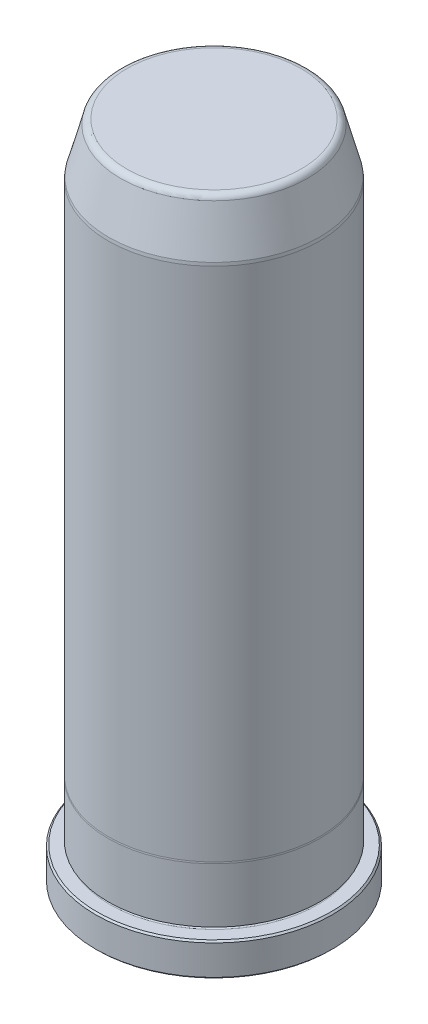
ISO-10303-21;
HEADER;
FILE_DESCRIPTION(('STEP AP214'),'2;1');
FILE_NAME('part.step','',(''),(''),'','','');
FILE_SCHEMA(('AUTOMOTIVE_DESIGN { 1 0 10303 214 1 1 1 1 }'));
ENDSEC;
DATA;
#1=APPLICATION_CONTEXT('core data for automotive mechanical design processes');
#2=APPLICATION_PROTOCOL_DEFINITION('international standard','automotive_design',2000,#1);
#3=PRODUCT_CONTEXT('',#1,'mechanical');
#4=PRODUCT('Part','Part','',(#3));
#5=PRODUCT_RELATED_PRODUCT_CATEGORY('part','',(#4));
#6=PRODUCT_DEFINITION_FORMATION('','',#4);
#7=PRODUCT_DEFINITION_CONTEXT('part definition',#1,'design');
#8=PRODUCT_DEFINITION('design','',#6,#7);
#9=PRODUCT_DEFINITION_SHAPE('','',#8);
#10=(LENGTH_UNIT() NAMED_UNIT(*) SI_UNIT(.MILLI.,.METRE.));
#11=(NAMED_UNIT(*) PLANE_ANGLE_UNIT() SI_UNIT($,.RADIAN.));
#12=(NAMED_UNIT(*) SI_UNIT($,.STERADIAN.) SOLID_ANGLE_UNIT());
#13=UNCERTAINTY_MEASURE_WITH_UNIT(LENGTH_MEASURE(1.E-05),#10,'distance_accuracy_value','');
#14=(GEOMETRIC_REPRESENTATION_CONTEXT(3) GLOBAL_UNCERTAINTY_ASSIGNED_CONTEXT((#13)) GLOBAL_UNIT_ASSIGNED_CONTEXT((#10,
#11,#12)) REPRESENTATION_CONTEXT('',''));
#15=CARTESIAN_POINT('',(0.,0.,0.));
#16=DIRECTION('',(0.,0.,1.));
#17=DIRECTION('',(1.,0.,0.));
#18=AXIS2_PLACEMENT_3D('',#15,#16,#17);
#19=CARTESIAN_POINT('',(0.,-1.48687287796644E-13,0.));
#20=DIRECTION('',(0.,1.,0.));
#21=DIRECTION('',(0.,0.,1.));
#22=AXIS2_PLACEMENT_3D('',#19,#20,#21);
#23=PLANE('',#22);
#24=CARTESIAN_POINT('',(0.,-1.48687287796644E-13,0.));
#25=DIRECTION('',(0.,1.,0.));
#26=DIRECTION('',(0.,0.,1.));
#27=AXIS2_PLACEMENT_3D('',#24,#25,#26);
#28=CIRCLE('',#27,28.0670000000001);
#29=CARTESIAN_POINT('',(0.,-4.42079168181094E-13,28.0670000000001));
#30=VERTEX_POINT('',#29);
#31=EDGE_CURVE('E37',#30,#30,#28,.F.);
#32=ORIENTED_EDGE('',*,*,#31,.T.);
#33=EDGE_LOOP('',(#32));
#34=FACE_BOUND('',#33,.T.);
#35=ADVANCED_FACE('F30',(#34),#23,.F.);
#36=CARTESIAN_POINT('',(0.,0.,0.));
#37=DIRECTION('',(0.,1.,0.));
#38=DIRECTION('',(0.,0.,1.));
#39=AXIS2_PLACEMENT_3D('',#36,#37,#38);
#40=CYLINDRICAL_SURFACE('',#39,28.448);
#41=CARTESIAN_POINT('',(0.,0.380999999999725,0.));
#42=DIRECTION('',(0.,1.,0.));
#43=DIRECTION('',(0.,0.,1.));
#44=AXIS2_PLACEMENT_3D('',#41,#42,#43);
#45=CIRCLE('',#44,28.448);
#46=CARTESIAN_POINT('',(0.,0.380999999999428,28.448));
#47=VERTEX_POINT('',#46);
#48=EDGE_CURVE('E41',#47,#47,#45,.T.);
#49=ORIENTED_EDGE('',*,*,#48,.T.);
#50=EDGE_LOOP('',(#49));
#51=FACE_BOUND('',#50,.T.);
#52=CARTESIAN_POINT('',(0.,7.54379999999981,0.));
#53=DIRECTION('',(0.,-1.,0.));
#54=DIRECTION('',(0.,0.,-1.));
#55=AXIS2_PLACEMENT_3D('',#52,#53,#54);
#56=CIRCLE('',#55,28.448);
#57=CARTESIAN_POINT('',(0.,7.5438000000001,-28.448));
#58=VERTEX_POINT('',#57);
#59=EDGE_CURVE('E45',#58,#58,#56,.T.);
#60=ORIENTED_EDGE('',*,*,#59,.T.);
#61=EDGE_LOOP('',(#60));
#62=FACE_BOUND('',#61,.T.);
#63=ADVANCED_FACE('F118',(#51,#62),#40,.T.);
#64=CARTESIAN_POINT('',(0.,7.92480000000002,-28.448));
#65=DIRECTION('',(0.,-1.,0.));
#66=DIRECTION('',(0.,0.,-1.));
#67=AXIS2_PLACEMENT_3D('',#64,#65,#66);
#68=PLANE('',#67);
#69=CARTESIAN_POINT('',(0.,7.92479999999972,0.));
#70=DIRECTION('',(0.,-1.,0.));
#71=DIRECTION('',(0.,0.,-1.));
#72=AXIS2_PLACEMENT_3D('',#69,#70,#71);
#73=CIRCLE('',#72,28.0670000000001);
#74=CARTESIAN_POINT('',(0.,7.92480000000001,-28.067));
#75=VERTEX_POINT('',#74);
#76=EDGE_CURVE('E10',#75,#75,#73,.F.);
#77=ORIENTED_EDGE('',*,*,#76,.T.);
#78=EDGE_LOOP('',(#77));
#79=FACE_BOUND('',#78,.T.);
#80=CARTESIAN_POINT('',(0.,7.92479999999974,0.));
#81=DIRECTION('',(0.,1.,0.));
#82=DIRECTION('',(0.,0.,1.));
#83=AXIS2_PLACEMENT_3D('',#80,#81,#82);
#84=CIRCLE('',#83,25.0063000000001);
#85=CARTESIAN_POINT('',(0.,7.92479999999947,25.0063000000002));
#86=VERTEX_POINT('',#85);
#87=EDGE_CURVE('E56',#86,#86,#84,.T.);
#88=ORIENTED_EDGE('',*,*,#87,.F.);
#89=EDGE_LOOP('',(#88));
#90=FACE_BOUND('',#89,.T.);
#91=ADVANCED_FACE('F113',(#79,#90),#68,.F.);
#92=CARTESIAN_POINT('',(0.,8.30579999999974,0.));
#93=DIRECTION('',(0.,1.,0.));
#94=DIRECTION('',(0.,0.,1.));
#95=AXIS2_PLACEMENT_3D('',#92,#93,#94);
#96=TOROIDAL_SURFACE('',#95,25.0063000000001,0.381000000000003);
#97=CARTESIAN_POINT('',(0.,8.68679999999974,0.));
#98=DIRECTION('',(0.,1.,0.));
#99=DIRECTION('',(0.,0.,1.));
#100=AXIS2_PLACEMENT_3D('',#97,#98,#99);
#101=CIRCLE('',#100,25.0063000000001);
#102=CARTESIAN_POINT('',(0.,8.68679999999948,25.0063000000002));
#103=VERTEX_POINT('',#102);
#104=EDGE_CURVE('E59',#103,#103,#101,.T.);
#105=ORIENTED_EDGE('',*,*,#104,.F.);
#106=EDGE_LOOP('',(#105));
#107=FACE_BOUND('',#106,.T.);
#108=ORIENTED_EDGE('',*,*,#87,.T.);
#109=EDGE_LOOP('',(#108));
#110=FACE_BOUND('',#109,.T.);
#111=ADVANCED_FACE('F107',(#107,#110),#96,.F.);
#112=CARTESIAN_POINT('',(0.,8.6868,-25.0063));
#113=DIRECTION('',(0.,1.,0.));
#114=DIRECTION('',(0.,0.,1.));
#115=AXIS2_PLACEMENT_3D('',#112,#113,#114);
#116=PLANE('',#115);
#117=CARTESIAN_POINT('',(0.,8.68679999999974,0.));
#118=DIRECTION('',(0.,1.,0.));
#119=DIRECTION('',(0.,0.,1.));
#120=AXIS2_PLACEMENT_3D('',#117,#118,#119);
#121=CIRCLE('',#120,25.4127000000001);
#122=CARTESIAN_POINT('',(0.,8.68679999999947,25.4127000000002));
#123=VERTEX_POINT('',#122);
#124=EDGE_CURVE('E62',#123,#123,#121,.T.);
#125=ORIENTED_EDGE('',*,*,#124,.F.);
#126=EDGE_LOOP('',(#125));
#127=FACE_BOUND('',#126,.T.);
#128=ORIENTED_EDGE('',*,*,#104,.T.);
#129=EDGE_LOOP('',(#128));
#130=FACE_BOUND('',#129,.T.);
#131=ADVANCED_FACE('F101',(#127,#130),#116,.F.);
#132=CARTESIAN_POINT('',(0.,0.,0.));
#133=DIRECTION('',(0.,1.,0.));
#134=DIRECTION('',(0.,0.,1.));
#135=AXIS2_PLACEMENT_3D('',#132,#133,#134);
#136=CYLINDRICAL_SURFACE('',#135,25.4127000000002);
#137=CARTESIAN_POINT('',(0.,21.8617630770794,2.28526874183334E-13));
#138=DIRECTION('',(0.,1.,0.));
#139=DIRECTION('',(0.,0.,1.));
#140=AXIS2_PLACEMENT_3D('',#137,#138,#139);
#141=CIRCLE('',#140,25.4127000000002);
#142=CARTESIAN_POINT('',(0.,21.8617630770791,25.4127000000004));
#143=VERTEX_POINT('',#142);
#144=EDGE_CURVE('E65',#143,#143,#141,.T.);
#145=ORIENTED_EDGE('',*,*,#144,.F.);
#146=EDGE_LOOP('',(#145));
#147=FACE_BOUND('',#146,.T.);
#148=ORIENTED_EDGE('',*,*,#124,.T.);
#149=EDGE_LOOP('',(#148));
#150=FACE_BOUND('',#149,.T.);
#151=ADVANCED_FACE('F95',(#147,#150),#136,.T.);
#152=CARTESIAN_POINT('',(0.,21.8617630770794,2.28526874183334E-13));
#153=DIRECTION('',(0.,-1.,0.));
#154=DIRECTION('',(0.,0.,-1.));
#155=AXIS2_PLACEMENT_3D('',#152,#153,#154);
#156=CONICAL_SURFACE('',#155,25.4127000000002,0.0698131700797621);
#157=CARTESIAN_POINT('',(0.,22.2249999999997,2.32323887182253E-13));
#158=DIRECTION('',(0.,1.,0.));
#159=DIRECTION('',(0.,0.,1.));
#160=AXIS2_PLACEMENT_3D('',#157,#158,#159);
#161=CIRCLE('',#160,25.3873000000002);
#162=CARTESIAN_POINT('',(0.,22.2249999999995,25.3873000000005));
#163=VERTEX_POINT('',#162);
#164=EDGE_CURVE('E68',#163,#163,#161,.T.);
#165=ORIENTED_EDGE('',*,*,#164,.F.);
#166=EDGE_LOOP('',(#165));
#167=FACE_BOUND('',#166,.T.);
#168=ORIENTED_EDGE('',*,*,#144,.T.);
#169=EDGE_LOOP('',(#168));
#170=FACE_BOUND('',#169,.T.);
#171=ADVANCED_FACE('F89',(#167,#170),#156,.T.);
#172=CARTESIAN_POINT('',(0.,0.,0.));
#173=DIRECTION('',(0.,1.,0.));
#174=DIRECTION('',(0.,0.,1.));
#175=AXIS2_PLACEMENT_3D('',#172,#173,#174);
#176=CYLINDRICAL_SURFACE('',#175,25.3873000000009);
#177=CARTESIAN_POINT('',(0.,146.05,1.52669983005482E-12));
#178=DIRECTION('',(0.,1.,0.));
#179=DIRECTION('',(0.,0.,1.));
#180=AXIS2_PLACEMENT_3D('',#177,#178,#179);
#181=CIRCLE('',#180,25.3873000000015);
#182=CARTESIAN_POINT('',(0.,146.049999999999,25.387300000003));
#183=VERTEX_POINT('',#182);
#184=EDGE_CURVE('E71',#183,#183,#181,.T.);
#185=ORIENTED_EDGE('',*,*,#184,.F.);
#186=EDGE_LOOP('',(#185));
#187=FACE_BOUND('',#186,.T.);
#188=ORIENTED_EDGE('',*,*,#164,.T.);
#189=EDGE_LOOP('',(#188));
#190=FACE_BOUND('',#189,.T.);
#191=ADVANCED_FACE('F83',(#187,#190),#176,.T.);
#192=CARTESIAN_POINT('',(0.,146.05,1.52669983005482E-12));
#193=DIRECTION('',(0.,-1.,0.));
#194=DIRECTION('',(0.,0.,-1.));
#195=AXIS2_PLACEMENT_3D('',#192,#193,#194);
#196=CONICAL_SURFACE('',#195,25.3873000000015,0.0872664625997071);
#197=CARTESIAN_POINT('',(0.,146.812,1.5346652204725E-12));
#198=DIRECTION('',(0.,1.,0.));
#199=DIRECTION('',(0.,0.,1.));
#200=AXIS2_PLACEMENT_3D('',#197,#198,#199);
#201=CIRCLE('',#200,25.3206336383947);
#202=CARTESIAN_POINT('',(0.,146.811999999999,25.3206336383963));
#203=VERTEX_POINT('',#202);
#204=EDGE_CURVE('E74',#203,#203,#201,.T.);
#205=ORIENTED_EDGE('',*,*,#204,.F.);
#206=EDGE_LOOP('',(#205));
#207=FACE_BOUND('',#206,.T.);
#208=ORIENTED_EDGE('',*,*,#184,.T.);
#209=EDGE_LOOP('',(#208));
#210=FACE_BOUND('',#209,.T.);
#211=ADVANCED_FACE('F80',(#207,#210),#196,.T.);
#212=CARTESIAN_POINT('',(0.,146.812,1.5346652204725E-12));
#213=DIRECTION('',(0.,-1.,0.));
#214=DIRECTION('',(0.,0.,-1.));
#215=AXIS2_PLACEMENT_3D('',#212,#213,#214);
#216=CONICAL_SURFACE('',#215,25.3206336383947,0.26179938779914);
#217=CARTESIAN_POINT('',(0.,157.5733752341,1.64715676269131E-12));
#218=DIRECTION('',(0.,1.,0.));
#219=DIRECTION('',(0.,0.,1.));
#220=AXIS2_PLACEMENT_3D('',#217,#218,#219);
#221=CIRCLE('',#220,22.4371318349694);
#222=CARTESIAN_POINT('',(0.,157.5733752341,22.437131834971));
#223=VERTEX_POINT('',#222);
#224=EDGE_CURVE('E50',#223,#223,#221,.F.);
#225=ORIENTED_EDGE('',*,*,#224,.T.);
#226=EDGE_LOOP('',(#225));
#227=FACE_BOUND('',#226,.T.);
#228=ORIENTED_EDGE('',*,*,#204,.T.);
#229=EDGE_LOOP('',(#228));
#230=FACE_BOUND('',#229,.T.);
#231=ADVANCED_FACE('F78',(#227,#230),#216,.T.);
#232=CARTESIAN_POINT('',(0.,158.75,-22.1218561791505));
#233=DIRECTION('',(0.,-1.,0.));
#234=DIRECTION('',(0.,0.,-1.));
#235=AXIS2_PLACEMENT_3D('',#232,#233,#234);
#236=PLANE('',#235);
#237=CARTESIAN_POINT('',(0.,158.75,1.65945633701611E-12));
#238=DIRECTION('',(0.,-1.,0.));
#239=DIRECTION('',(0.,0.,-1.));
#240=AXIS2_PLACEMENT_3D('',#237,#238,#239);
#241=CIRCLE('',#240,20.9037245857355);
#242=CARTESIAN_POINT('',(0.,158.75,-20.9037245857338));
#243=VERTEX_POINT('',#242);
#244=EDGE_CURVE('E53',#243,#243,#241,.F.);
#245=ORIENTED_EDGE('',*,*,#244,.T.);
#246=EDGE_LOOP('',(#245));
#247=FACE_BOUND('',#246,.T.);
#248=ADVANCED_FACE('F133',(#247),#236,.F.);
#249=CARTESIAN_POINT('',(0.,157.1625,1.64286177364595E-12));
#250=DIRECTION('',(0.,-1.,0.));
#251=DIRECTION('',(0.,0.,-1.));
#252=AXIS2_PLACEMENT_3D('',#249,#250,#251);
#253=TOROIDAL_SURFACE('',#252,20.9037245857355,1.5875);
#254=ORIENTED_EDGE('',*,*,#224,.F.);
#255=EDGE_LOOP('',(#254));
#256=FACE_BOUND('',#255,.T.);
#257=ORIENTED_EDGE('',*,*,#244,.F.);
#258=EDGE_LOOP('',(#257));
#259=FACE_BOUND('',#258,.T.);
#260=ADVANCED_FACE('F130',(#256,#259),#253,.T.);
#261=CARTESIAN_POINT('',(0.,0.380999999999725,0.));
#262=DIRECTION('',(0.,1.,0.));
#263=DIRECTION('',(0.,0.,1.));
#264=AXIS2_PLACEMENT_3D('',#261,#262,#263);
#265=CONICAL_SURFACE('',#264,28.448,0.785398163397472);
#266=ORIENTED_EDGE('',*,*,#31,.F.);
#267=EDGE_LOOP('',(#266));
#268=FACE_BOUND('',#267,.T.);
#269=ORIENTED_EDGE('',*,*,#48,.F.);
#270=EDGE_LOOP('',(#269));
#271=FACE_BOUND('',#270,.T.);
#272=ADVANCED_FACE('F132',(#268,#271),#265,.T.);
#273=CARTESIAN_POINT('',(0.,7.92479999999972,0.));
#274=DIRECTION('',(0.,-1.,0.));
#275=DIRECTION('',(0.,0.,-1.));
#276=AXIS2_PLACEMENT_3D('',#273,#274,#275);
#277=CONICAL_SURFACE('',#276,28.0670000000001,0.785398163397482);
#278=ORIENTED_EDGE('',*,*,#59,.F.);
#279=EDGE_LOOP('',(#278));
#280=FACE_BOUND('',#279,.T.);
#281=ORIENTED_EDGE('',*,*,#76,.F.);
#282=EDGE_LOOP('',(#281));
#283=FACE_BOUND('',#282,.T.);
#284=ADVANCED_FACE('F32',(#280,#283),#277,.T.);
#285=CLOSED_SHELL('',(#35,#63,#91,#111,#131,#151,#171,#191,#211,#231,#248,#260,#272,#284));
#286=MANIFOLD_SOLID_BREP('B2',#285);
#287=ADVANCED_BREP_SHAPE_REPRESENTATION('',(#18,#286),#14);
#288=SHAPE_DEFINITION_REPRESENTATION(#9,#287);
ENDSEC;
END-ISO-10303-21;
